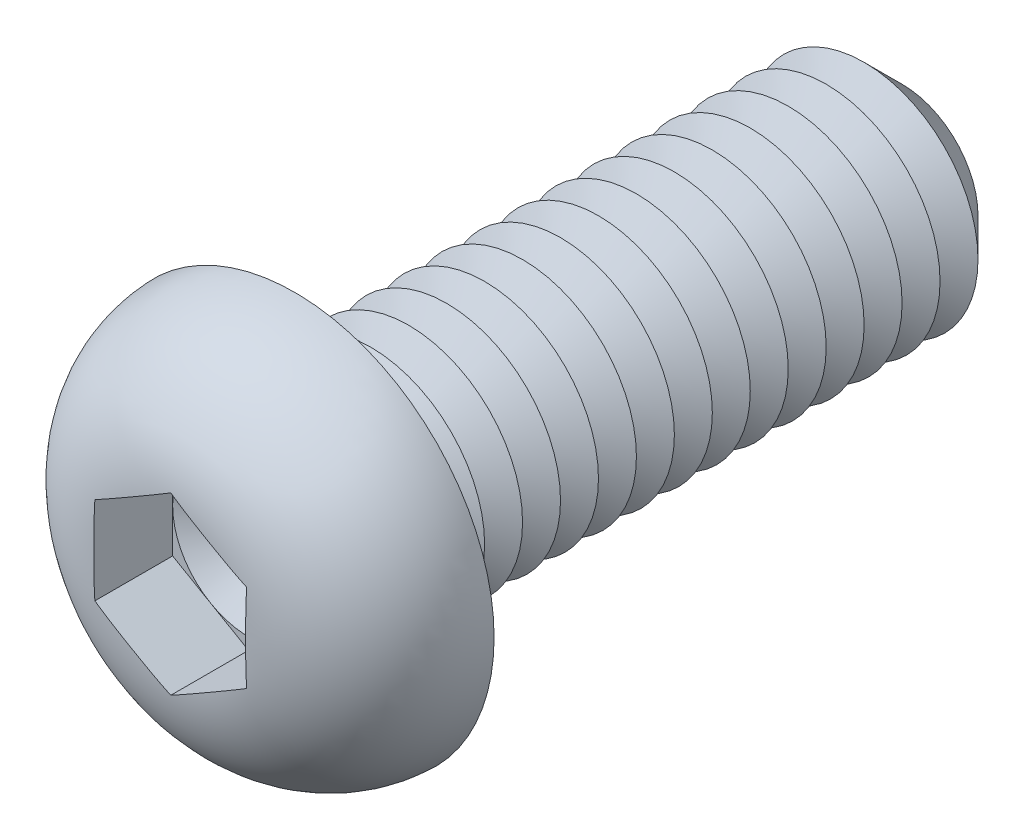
from build123d import *

# Parameters (mm, degrees)
CUT_EXTRUDE1_DEPTH  = 2.08
SKETCH4_R           = 3
BOSS_EXTRUDE1_DEPTH = 16
CHAMFER1_SIZE       = 1
LPATTERN1_COUNT     = 14
LPATTERN1_PITCH     = 1
FILLET2_R           = 0.5


with BuildPart() as part:
    # Sketch2 → Revolve1 (revolve)
    with BuildSketch(Plane(origin=(0, 0, 0), x_dir=(0, 0, -1), z_dir=(1, 0, 0)), mode=Mode.PRIVATE) as revolve1_sk:
        with BuildLine():
            Line((0, 0), (-3.3, 0))
            Line((-3.3, 0), (-3.3, 1.851470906))
            ThreePointArc((-3.3, 1.851470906), (-2.339262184, 4.220014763), (0, 5.25))
            Line((0, 5.25), (0, 0))
        make_face()
    revolve(revolve1_sk.sketch.rotate(Axis((0, 0, 47.934239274), (0, 0, -1)), 90), axis=Axis((0, 0, 47.934239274), (0, 0, -1)))

    # Sketch3 → Cut-Extrude1 (cut)
    with BuildSketch(Plane.XY.offset(3.3)):
        Polygon((0, 2.309401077), (-2, 1.154700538), (-2, -1.154700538), (0, -2.309401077), (2, -1.154700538), (2, 1.154700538), align=None)
    extrude(amount=-CUT_EXTRUDE1_DEPTH, mode=Mode.SUBTRACT)

    # Sketch4 → Boss-Extrude1 (add)
    with BuildSketch(Plane(origin=(0, 0, 0), x_dir=(-1, 0, 0), z_dir=(0, 0, -1))):
        Circle(SKETCH4_R)
    extrude(amount=BOSS_EXTRUDE1_DEPTH)

    # Chamfer1
    chamfer1_edges = [part.edges().sort_by_distance(p)[0] for p in [
        (3, 0, -16),
    ]]
    chamfer(chamfer1_edges, length=CHAMFER1_SIZE)

    # Sketch5 → Cut-Revolve1 (revolve, cut)
    with BuildSketch(Plane(origin=(0, 0, 0), x_dir=(0, 0, -1), z_dir=(1, 0, 0)), mode=Mode.PRIVATE) as cut_revolve1_sk:
        Polygon((1, 3), (2, 3), (1.5, 2.133974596), align=None)
    cut_revolve1 = revolve(cut_revolve1_sk.sketch.rotate(Axis((0, 0, 47.934239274), (0, 0, -1)), 90), axis=Axis((0, 0, 47.934239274), (0, 0, -1)), mode=Mode.SUBTRACT)

    # LPattern1: Cut-Revolve1 ×14
    with Locations(*[(0, 0, -i * LPATTERN1_PITCH) for i in range(1, LPATTERN1_COUNT)]):
        add(cut_revolve1, mode=Mode.SUBTRACT)

    # Fillet2
    fillet2_edges = [part.edges().sort_by_distance(p)[0] for p in [
        (3, 0, 0),
    ]]
    fillet(fillet2_edges, radius=FILLET2_R)

    # Cut-Extrude2 cone 1 section (on through the dimple's axis) → Cut-Extrude2 (revolve, cut)
    with BuildSketch(Plane(origin=(0, 0, 1.22), x_dir=(0, -1, 0), z_dir=(1, 0, 0))):
        Polygon((0, 0), (2, 0), (0, 1.154700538), align=None)
    revolve(axis=Axis((0, 0, 1.22), (0, 0, -1)), mode=Mode.SUBTRACT)


solid = part.part
